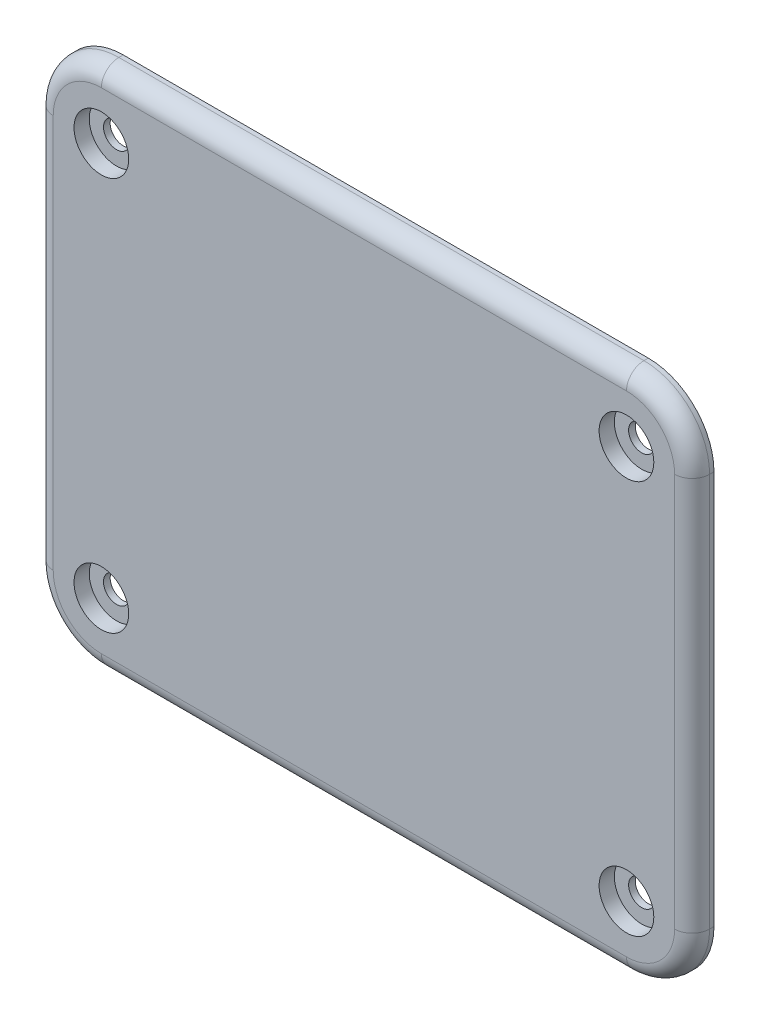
from build123d import *

# Parameters (mm, degrees)
BASE_EXTRUDE_DEPTH                                  = 3.175
CBORE_FOR_6_BINDING_HEAD_MACHINE_SCREW1_D           = 3.7973
CBORE_FOR_6_BINDING_HEAD_MACHINE_SCREW1_CBORE_D     = 7.9375
CBORE_FOR_6_BINDING_HEAD_MACHINE_SCREW1_CBORE_DEPTH = 2.2098
FILLET1_R                                           = 2.54


with BuildPart() as part:
    # Sketch1 → Base-Extrude (new body)
    with BuildSketch(Plane.XY):
        with BuildLine():
            Line((38.1, 107.95), (-38.1, 107.95))
            ThreePointArc((-38.1, 107.95), (-44.835192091, 105.160192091), (-47.625, 98.425))
            Line((-47.625, 98.425), (-47.625, 41.275))
            ThreePointArc((-47.625, 41.275), (-44.835192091, 34.539807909), (-38.1, 31.75))
            Line((-38.1, 31.75), (38.1, 31.75))
            ThreePointArc((38.1, 31.75), (44.835192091, 34.539807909), (47.625, 41.275))
            Line((47.625, 41.275), (47.625, 98.425))
            ThreePointArc((47.625, 98.425), (44.835192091, 105.160192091), (38.1, 107.95))
        make_face()
    extrude(amount=BASE_EXTRUDE_DEPTH)

    # CBORE for _6 Binding Head Machine Screw1 (through all)
    with Locations(Plane.XY.offset(3.175)):
        with Locations((-38.1, 98.425), (38.1, 98.425), (38.1, 41.275), (-38.1, 41.275)):
            CounterBoreHole(CBORE_FOR_6_BINDING_HEAD_MACHINE_SCREW1_D / 2, CBORE_FOR_6_BINDING_HEAD_MACHINE_SCREW1_CBORE_D / 2, CBORE_FOR_6_BINDING_HEAD_MACHINE_SCREW1_CBORE_DEPTH)

    # Fillet1
    fillet1_edges = [part.edges().sort_by_distance(p)[0] for p in [
        (-44.835192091, 105.160192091, 3.175),
        (-47.625, 69.85, 3.175),
        (-44.835192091, 34.539807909, 3.175),
        (0, 31.75, 3.175),
        (44.835192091, 34.539807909, 3.175),
        (47.625, 69.85, 3.175),
        (44.835192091, 105.160192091, 3.175),
        (0, 107.95, 3.175),
    ]]
    fillet(fillet1_edges, radius=FILLET1_R)


solid = part.part
